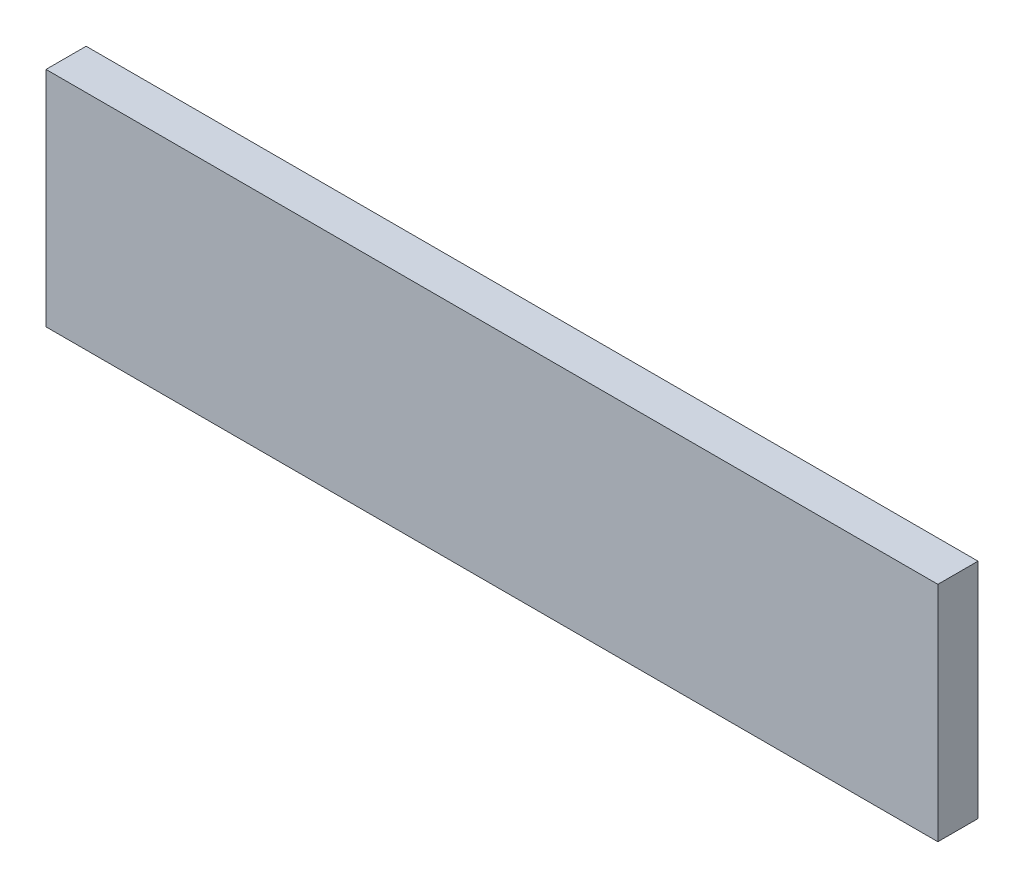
ISO-10303-21;
HEADER;
FILE_DESCRIPTION(('STEP AP214'),'2;1');
FILE_NAME('part.step','',(''),(''),'','','');
FILE_SCHEMA(('AUTOMOTIVE_DESIGN { 1 0 10303 214 1 1 1 1 }'));
ENDSEC;
DATA;
#1=APPLICATION_CONTEXT('core data for automotive mechanical design processes');
#2=APPLICATION_PROTOCOL_DEFINITION('international standard','automotive_design',2000,#1);
#3=PRODUCT_CONTEXT('',#1,'mechanical');
#4=PRODUCT('Part','Part','',(#3));
#5=PRODUCT_RELATED_PRODUCT_CATEGORY('part','',(#4));
#6=PRODUCT_DEFINITION_FORMATION('','',#4);
#7=PRODUCT_DEFINITION_CONTEXT('part definition',#1,'design');
#8=PRODUCT_DEFINITION('design','',#6,#7);
#9=PRODUCT_DEFINITION_SHAPE('','',#8);
#10=(LENGTH_UNIT() NAMED_UNIT(*) SI_UNIT(.MILLI.,.METRE.));
#11=(NAMED_UNIT(*) PLANE_ANGLE_UNIT() SI_UNIT($,.RADIAN.));
#12=(NAMED_UNIT(*) SI_UNIT($,.STERADIAN.) SOLID_ANGLE_UNIT());
#13=UNCERTAINTY_MEASURE_WITH_UNIT(LENGTH_MEASURE(1.E-05),#10,'distance_accuracy_value','');
#14=(GEOMETRIC_REPRESENTATION_CONTEXT(3) GLOBAL_UNCERTAINTY_ASSIGNED_CONTEXT((#13)) GLOBAL_UNIT_ASSIGNED_CONTEXT((#10,
#11,#12)) REPRESENTATION_CONTEXT('',''));
#15=CARTESIAN_POINT('',(0.,0.,0.));
#16=DIRECTION('',(0.,0.,1.));
#17=DIRECTION('',(1.,0.,0.));
#18=AXIS2_PLACEMENT_3D('',#15,#16,#17);
#19=CARTESIAN_POINT('',(0.,-5.,1.8));
#20=DIRECTION('',(1.,0.,0.));
#21=DIRECTION('',(0.,0.,-1.));
#22=AXIS2_PLACEMENT_3D('',#19,#20,#21);
#23=PLANE('',#22);
#24=DIRECTION('',(0.,-1.,0.));
#25=VECTOR('',#24,1.);
#26=CARTESIAN_POINT('',(0.,-5.,0.));
#27=LINE('',#26,#25);
#28=CARTESIAN_POINT('',(0.,5.,0.));
#29=VERTEX_POINT('',#28);
#30=CARTESIAN_POINT('',(0.,-5.,0.));
#31=VERTEX_POINT('',#30);
#32=EDGE_CURVE('E97',#29,#31,#27,.T.);
#33=ORIENTED_EDGE('',*,*,#32,.T.);
#34=DIRECTION('',(0.,0.,-1.));
#35=VECTOR('',#34,1.);
#36=CARTESIAN_POINT('',(0.,-5.,1.8));
#37=LINE('',#36,#35);
#38=CARTESIAN_POINT('',(0.,-5.,1.8));
#39=VERTEX_POINT('',#38);
#40=EDGE_CURVE('E11',#39,#31,#37,.T.);
#41=ORIENTED_EDGE('',*,*,#40,.F.);
#42=DIRECTION('',(0.,-1.,0.));
#43=VECTOR('',#42,1.);
#44=CARTESIAN_POINT('',(0.,-5.,1.8));
#45=LINE('',#44,#43);
#46=CARTESIAN_POINT('',(0.,5.,1.8));
#47=VERTEX_POINT('',#46);
#48=EDGE_CURVE('E85',#47,#39,#45,.T.);
#49=ORIENTED_EDGE('',*,*,#48,.F.);
#50=DIRECTION('',(0.,0.,-1.));
#51=VECTOR('',#50,1.);
#52=CARTESIAN_POINT('',(0.,5.,1.8));
#53=LINE('',#52,#51);
#54=EDGE_CURVE('E93',#47,#29,#53,.T.);
#55=ORIENTED_EDGE('',*,*,#54,.T.);
#56=EDGE_LOOP('',(#33,#41,#49,#55));
#57=FACE_BOUND('',#56,.T.);
#58=ADVANCED_FACE('F34',(#57),#23,.F.);
#59=CARTESIAN_POINT('',(0.,-5.,1.8));
#60=DIRECTION('',(0.,1.,0.));
#61=DIRECTION('',(-1.,0.,0.));
#62=AXIS2_PLACEMENT_3D('',#59,#60,#61);
#63=PLANE('',#62);
#64=DIRECTION('',(1.,0.,0.));
#65=VECTOR('',#64,1.);
#66=CARTESIAN_POINT('',(0.,-5.,0.));
#67=LINE('',#66,#65);
#68=CARTESIAN_POINT('',(40.,-5.,0.));
#69=VERTEX_POINT('',#68);
#70=EDGE_CURVE('E89',#31,#69,#67,.T.);
#71=ORIENTED_EDGE('',*,*,#70,.T.);
#72=DIRECTION('',(0.,0.,-1.));
#73=VECTOR('',#72,1.);
#74=CARTESIAN_POINT('',(40.,-5.,1.8));
#75=LINE('',#74,#73);
#76=CARTESIAN_POINT('',(40.,-5.,1.8));
#77=VERTEX_POINT('',#76);
#78=EDGE_CURVE('E42',#77,#69,#75,.T.);
#79=ORIENTED_EDGE('',*,*,#78,.F.);
#80=DIRECTION('',(1.,0.,0.));
#81=VECTOR('',#80,1.);
#82=CARTESIAN_POINT('',(0.,-5.,1.8));
#83=LINE('',#82,#81);
#84=EDGE_CURVE('E80',#39,#77,#83,.T.);
#85=ORIENTED_EDGE('',*,*,#84,.F.);
#86=ORIENTED_EDGE('',*,*,#40,.T.);
#87=EDGE_LOOP('',(#71,#79,#85,#86));
#88=FACE_BOUND('',#87,.T.);
#89=ADVANCED_FACE('F88',(#88),#63,.F.);
#90=CARTESIAN_POINT('',(40.,5.,1.8));
#91=DIRECTION('',(-1.,0.,0.));
#92=DIRECTION('',(0.,0.,1.));
#93=AXIS2_PLACEMENT_3D('',#90,#91,#92);
#94=PLANE('',#93);
#95=DIRECTION('',(0.,1.,0.));
#96=VECTOR('',#95,1.);
#97=CARTESIAN_POINT('',(40.,5.,0.));
#98=LINE('',#97,#96);
#99=CARTESIAN_POINT('',(40.,5.,0.));
#100=VERTEX_POINT('',#99);
#101=EDGE_CURVE('E67',#69,#100,#98,.T.);
#102=ORIENTED_EDGE('',*,*,#101,.T.);
#103=DIRECTION('',(0.,0.,-1.));
#104=VECTOR('',#103,1.);
#105=CARTESIAN_POINT('',(40.,5.,1.8));
#106=LINE('',#105,#104);
#107=CARTESIAN_POINT('',(40.,5.,1.8));
#108=VERTEX_POINT('',#107);
#109=EDGE_CURVE('E90',#108,#100,#106,.T.);
#110=ORIENTED_EDGE('',*,*,#109,.F.);
#111=DIRECTION('',(0.,1.,0.));
#112=VECTOR('',#111,1.);
#113=CARTESIAN_POINT('',(40.,5.,1.8));
#114=LINE('',#113,#112);
#115=EDGE_CURVE('E83',#77,#108,#114,.T.);
#116=ORIENTED_EDGE('',*,*,#115,.F.);
#117=ORIENTED_EDGE('',*,*,#78,.T.);
#118=EDGE_LOOP('',(#102,#110,#116,#117));
#119=FACE_BOUND('',#118,.T.);
#120=ADVANCED_FACE('F91',(#119),#94,.F.);
#121=CARTESIAN_POINT('',(0.,5.,1.8));
#122=DIRECTION('',(0.,-1.,0.));
#123=DIRECTION('',(0.,0.,-1.));
#124=AXIS2_PLACEMENT_3D('',#121,#122,#123);
#125=PLANE('',#124);
#126=DIRECTION('',(-1.,0.,0.));
#127=VECTOR('',#126,1.);
#128=CARTESIAN_POINT('',(0.,5.,0.));
#129=LINE('',#128,#127);
#130=EDGE_CURVE('E73',#100,#29,#129,.T.);
#131=ORIENTED_EDGE('',*,*,#130,.T.);
#132=ORIENTED_EDGE('',*,*,#54,.F.);
#133=DIRECTION('',(-1.,0.,0.));
#134=VECTOR('',#133,1.);
#135=CARTESIAN_POINT('',(0.,5.,1.8));
#136=LINE('',#135,#134);
#137=EDGE_CURVE('E50',#108,#47,#136,.T.);
#138=ORIENTED_EDGE('',*,*,#137,.F.);
#139=ORIENTED_EDGE('',*,*,#109,.T.);
#140=EDGE_LOOP('',(#131,#132,#138,#139));
#141=FACE_BOUND('',#140,.T.);
#142=ADVANCED_FACE('F104',(#141),#125,.F.);
#143=CARTESIAN_POINT('',(0.,5.,1.8));
#144=DIRECTION('',(0.,0.,-1.));
#145=DIRECTION('',(-1.,0.,0.));
#146=AXIS2_PLACEMENT_3D('',#143,#144,#145);
#147=PLANE('',#146);
#148=ORIENTED_EDGE('',*,*,#48,.T.);
#149=ORIENTED_EDGE('',*,*,#84,.T.);
#150=ORIENTED_EDGE('',*,*,#115,.T.);
#151=ORIENTED_EDGE('',*,*,#137,.T.);
#152=EDGE_LOOP('',(#148,#149,#150,#151));
#153=FACE_BOUND('',#152,.T.);
#154=ADVANCED_FACE('F81',(#153),#147,.F.);
#155=CARTESIAN_POINT('',(0.,5.,0.));
#156=DIRECTION('',(0.,0.,-1.));
#157=DIRECTION('',(-1.,0.,0.));
#158=AXIS2_PLACEMENT_3D('',#155,#156,#157);
#159=PLANE('',#158);
#160=ORIENTED_EDGE('',*,*,#32,.F.);
#161=ORIENTED_EDGE('',*,*,#130,.F.);
#162=ORIENTED_EDGE('',*,*,#101,.F.);
#163=ORIENTED_EDGE('',*,*,#70,.F.);
#164=EDGE_LOOP('',(#160,#161,#162,#163));
#165=FACE_BOUND('',#164,.T.);
#166=ADVANCED_FACE('F107',(#165),#159,.T.);
#167=CLOSED_SHELL('',(#58,#89,#120,#142,#154,#166));
#168=MANIFOLD_SOLID_BREP('B2',#167);
#169=ADVANCED_BREP_SHAPE_REPRESENTATION('',(#18,#168),#14);
#170=SHAPE_DEFINITION_REPRESENTATION(#9,#169);
ENDSEC;
END-ISO-10303-21;
